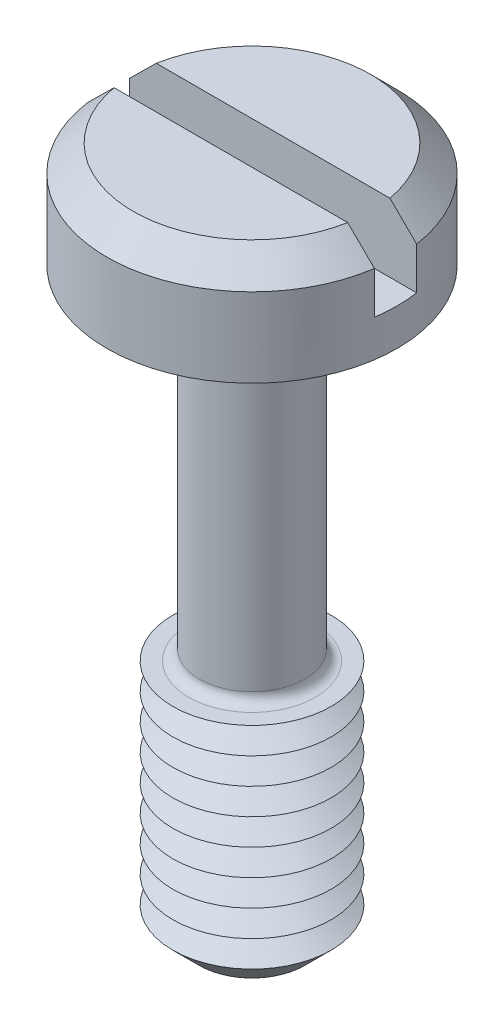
from build123d import *

# Parameters (mm, degrees)
SKETCH1_R           = 2.75
BOSS_EXTRUDE1_DEPTH = 2
SKETCH2_R           = 1
BOSS_EXTRUDE2_DEPTH = 11
SKETCH3_R           = 1.5
BOSS_EXTRUDE3_DEPTH = 4.5
CHAMFER1_SIZE       = 0.5
LPATTERN1_COUNT     = 8
LPATTERN1_PITCH     = 0.5
FILLET1_R           = 0.2
CHAMFER2_SIZE       = 0.5
SKETCH6_W           = 5.5
SKETCH6_H           = 0.8
CUT_EXTRUDE1_DEPTH  = 1.3


with BuildPart() as part:
    # Sketch1 → Boss-Extrude1 (new body)
    with BuildSketch(Plane(origin=(0, 0, 0), x_dir=(1, 0, 0), z_dir=(0, 1, 0))):
        with Locations(Location((0, 0, 0), (0, 0, 270))):
            Circle(SKETCH1_R)
    extrude(amount=BOSS_EXTRUDE1_DEPTH)

    # Sketch2 → Boss-Extrude2 (add)
    with BuildSketch(Plane.XZ):
        with Locations(Location((0, 0, 0), (0, 0, 270))):
            Circle(SKETCH2_R)
    extrude(amount=BOSS_EXTRUDE2_DEPTH)

    # Sketch3 → Boss-Extrude3 (add)
    with BuildSketch(Plane.XZ.offset(11)):
        with Locations(Location((0, 0, 0), (0, 0, 270))):
            Circle(SKETCH3_R)
    extrude(amount=-BOSS_EXTRUDE3_DEPTH)

    # Chamfer1
    chamfer1_edges = [part.edges().sort_by_distance(p)[0] for p in [
        (0, -11, 1.5),
    ]]
    chamfer(chamfer1_edges, length=CHAMFER1_SIZE)

    # Sketch5 → Cut-Revolve1 (revolve, cut)
    with BuildSketch(Plane(origin=(0, 0, 0), x_dir=(0, 0, -1), z_dir=(1, 0, 0))):
        Polygon((-1.5, -6.5), (-1.066987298, -6.75), (-1.5, -7), align=None)
    cut_revolve1 = revolve(axis=Axis((0, -6.58711856, 0), (0, -1, 0)), mode=Mode.SUBTRACT)

    # LPattern1: Cut-Revolve1 ×8
    with Locations(*[(0, -i * LPATTERN1_PITCH, 0) for i in range(1, LPATTERN1_COUNT)]):
        add(cut_revolve1, mode=Mode.SUBTRACT)

    # Fillet1
    fillet1_edges = [part.edges().sort_by_distance(p)[0] for p in [
        (0, 0, 1),
        (0, -6.5, 1),
    ]]
    fillet(fillet1_edges, radius=FILLET1_R)

    # Chamfer2
    chamfer2_edges = [part.edges().sort_by_distance(p)[0] for p in [
        (0, 2, -2.75),
    ]]
    chamfer(chamfer2_edges, length=CHAMFER2_SIZE)

    # Sketch6 → Cut-Extrude1 (cut)
    with BuildSketch(Plane(origin=(0, 2, 0), x_dir=(1, 0, 0), z_dir=(0, 1, 0))):
        Rectangle(SKETCH6_W, SKETCH6_H)
    extrude(amount=-CUT_EXTRUDE1_DEPTH, mode=Mode.SUBTRACT)


solid = part.part
